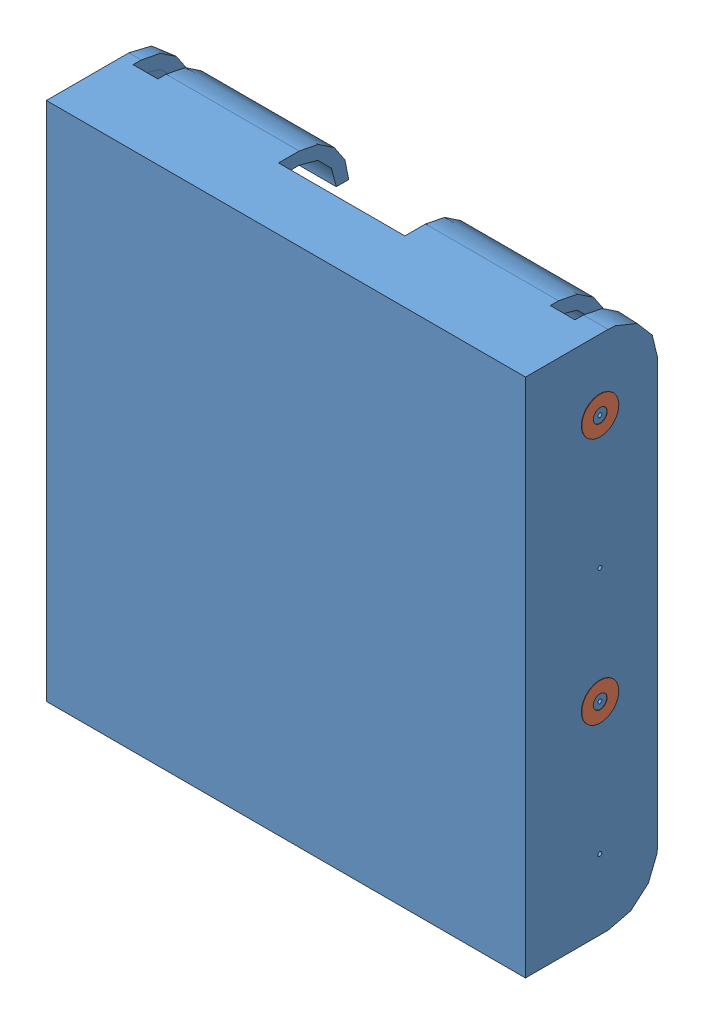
SolidWorks assembly Coupleur 4 piles complet.SLDASM, configuration Défaut (file format 5000). Lengths in mm.
Overall size (58.11 63 16).
9 component instances, 3 part files, 8 mates.
Components (placement in the parent):
- COUPLEUR 4PILES LR6  corps-1: COUPLEUR 4PILES LR6  corps.SLDPRT [Défaut] at (-4.3277 -2.6345 0) size (58.01 63 16)
- RESSORT PILE 2-1: RESSORT PILE 2.SLDPRT [Défaut] at (-30.6319 -10.8847 -8.9988) x (0 0.000099 -1) z (1 -0.000099 0) size (7.97 8 2.5)
- RESSORT PILE 2-2: RESSORT PILE 2.SLDPRT [Défaut] at (-30.629 19.1153 -8.9988) x (0 0.000099 -1) z (1 -0.000099 0) size (7.97 8 2.5)
- RESSORT PILE 2-3: RESSORT PILE 2.SLDPRT [Défaut] at (23.4726 35.1157 -9.0012) x (0 0.000099 1) z (-1 0.000099 0) size (7.97 8 2.5)
- RESSORT PILE 2-4: RESSORT PILE 2.SLDPRT [Défaut] at (23.4696 5.1157 -9.0012) x (0 0.000099 1) z (-1 0.000099 0) size (7.97 8 2.5)
- Ressort_contact-2: Ressort_contact.SLDPRT [Défaut] at (-31.2555 -6.8789 -9) x (-0.000085 -0.864499 -0.502634) z (1 -0.000099 0) size (4.02 3.91 9.75)
- Ressort_contact-3: Ressort_contact.SLDPRT [Défaut] at (-31.2393 23.1211 -9) x (-0.000089 -0.905579 -0.424177) z (1 -0.000099 0) size (4.02 3.91 9.75)
- Ressort_contact-4: Ressort_contact.SLDPRT [Défaut] at (24.0539 7.1099 -9) x (0 0.000099 1) z (-1 0.000099 0) size (4.02 3.91 9.75)
- Ressort_contact-5: Ressort_contact.SLDPRT [Défaut] at (24.0575 -22.8901 -9) x (-0.000002 -0.015733 0.999876) z (-1 0.000099 0) size (4.02 3.91 9.75)
Mates (geometry in assembly coordinates):
- Coïncidente1: coincident anti-aligned: axis of COUPLEUR 4PILES LR6  corps-1 through (-31.0802 7.1154 -9) axis (-1 0.000099 0); axis of RESSORT PILE 2-2 through (-32.4302 7.1155 -9) axis (1 -0.000099 0)
- Coïncidente2: coincident anti-aligned: axis of COUPLEUR 4PILES LR6  corps-1 through (-31.0831 -22.8846 -9) axis (-1 0.000099 0); axis of RESSORT PILE 2-1 through (-32.4331 -22.8845 -9) axis (1 -0.000099 0)
- Distance2: distance = 0.05 mm aligned: plane of COUPLEUR 4PILES LR6  corps-1 through (-32.5777 31.6155 -16) normal (-1 0.000099 0); plane of RESSORT PILE 2-1 through (-32.6331 -22.8845 -9) normal (-1 0.000099 0)
- Distance3: distance = 0.05 mm aligned: plane of COUPLEUR 4PILES LR6  corps-1 through (-32.5777 31.6155 -16) normal (-1 0.000099 0); plane of RESSORT PILE 2-2 through (-32.6302 7.1155 -9) normal (-1 0.000099 0)
- Coïncidente5: coincident anti-aligned: axis of COUPLEUR 4PILES LR6  corps-1 through (23.9214 23.1157 -9) axis (1 -0.000099 0); axis of RESSORT PILE 2-3 through (25.2714 23.1155 -9) axis (-1 0.000099 0)
- Coïncidente6: coincident anti-aligned: axis of COUPLEUR 4PILES LR6  corps-1 through (23.9185 -6.8843 -9) axis (1 -0.000099 0); axis of RESSORT PILE 2-4 through (25.2685 -6.8845 -9) axis (-1 0.000099 0)
- Distance4: distance = 0.05 mm aligned: plane of COUPLEUR 4PILES LR6  corps-1 through (25.4223 31.6155 -16) normal (1 -0.000099 0); plane of RESSORT PILE 2-4 through (25.4685 -6.8845 -9) normal (1 -0.000099 0)
- Distance5: distance = 0.05 mm aligned: plane of COUPLEUR 4PILES LR6  corps-1 through (25.4223 31.6155 -16) normal (1 -0.000099 0); plane of RESSORT PILE 2-3 through (25.4714 23.1155 -9) normal (1 -0.000099 0)
